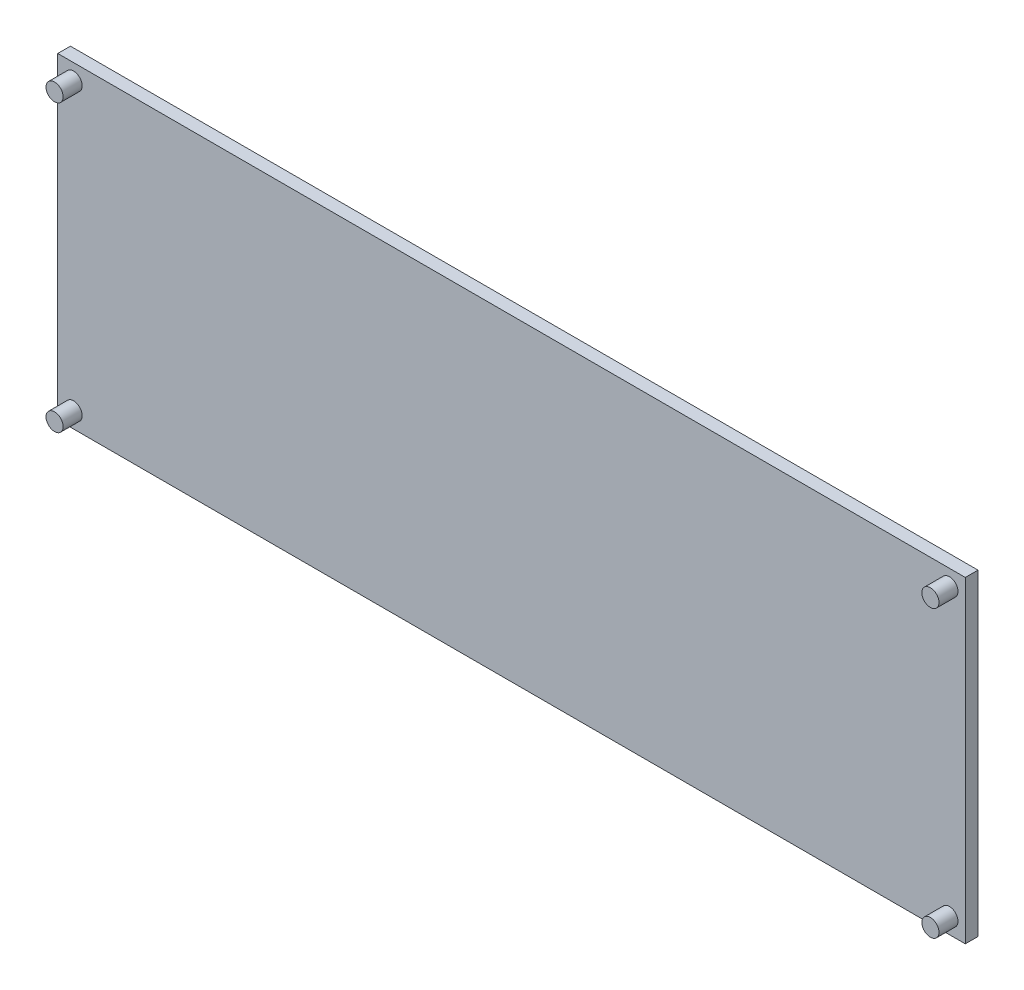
ISO-10303-21;
HEADER;
FILE_DESCRIPTION(('STEP AP214'),'2;1');
FILE_NAME('part.step','',(''),(''),'','','');
FILE_SCHEMA(('AUTOMOTIVE_DESIGN { 1 0 10303 214 1 1 1 1 }'));
ENDSEC;
DATA;
#1=APPLICATION_CONTEXT('core data for automotive mechanical design processes');
#2=APPLICATION_PROTOCOL_DEFINITION('international standard','automotive_design',2000,#1);
#3=PRODUCT_CONTEXT('',#1,'mechanical');
#4=PRODUCT('Part','Part','',(#3));
#5=PRODUCT_RELATED_PRODUCT_CATEGORY('part','',(#4));
#6=PRODUCT_DEFINITION_FORMATION('','',#4);
#7=PRODUCT_DEFINITION_CONTEXT('part definition',#1,'design');
#8=PRODUCT_DEFINITION('design','',#6,#7);
#9=PRODUCT_DEFINITION_SHAPE('','',#8);
#10=(LENGTH_UNIT() NAMED_UNIT(*) SI_UNIT(.MILLI.,.METRE.));
#11=(NAMED_UNIT(*) PLANE_ANGLE_UNIT() SI_UNIT($,.RADIAN.));
#12=(NAMED_UNIT(*) SI_UNIT($,.STERADIAN.) SOLID_ANGLE_UNIT());
#13=UNCERTAINTY_MEASURE_WITH_UNIT(LENGTH_MEASURE(1.E-05),#10,'distance_accuracy_value','');
#14=(GEOMETRIC_REPRESENTATION_CONTEXT(3) GLOBAL_UNCERTAINTY_ASSIGNED_CONTEXT((#13)) GLOBAL_UNIT_ASSIGNED_CONTEXT((#10,
#11,#12)) REPRESENTATION_CONTEXT('',''));
#15=CARTESIAN_POINT('',(0.,0.,0.));
#16=DIRECTION('',(0.,0.,1.));
#17=DIRECTION('',(1.,0.,0.));
#18=AXIS2_PLACEMENT_3D('',#15,#16,#17);
#19=CARTESIAN_POINT('',(0.,0.,2.));
#20=DIRECTION('',(0.,0.,-1.));
#21=DIRECTION('',(-1.,0.,0.));
#22=AXIS2_PLACEMENT_3D('',#19,#20,#21);
#23=PLANE('',#22);
#24=DIRECTION('',(0.,1.,0.));
#25=VECTOR('',#24,1.);
#26=CARTESIAN_POINT('',(71.5,-25.,2.));
#27=LINE('',#26,#25);
#28=CARTESIAN_POINT('',(71.5,-25.,2.));
#29=VERTEX_POINT('',#28);
#30=CARTESIAN_POINT('',(71.5,25.,2.));
#31=VERTEX_POINT('',#30);
#32=EDGE_CURVE('E89',#29,#31,#27,.T.);
#33=ORIENTED_EDGE('',*,*,#32,.T.);
#34=DIRECTION('',(-1.,0.,0.));
#35=VECTOR('',#34,1.);
#36=CARTESIAN_POINT('',(-71.5,25.,2.));
#37=LINE('',#36,#35);
#38=CARTESIAN_POINT('',(-71.5,25.,2.));
#39=VERTEX_POINT('',#38);
#40=EDGE_CURVE('E84',#31,#39,#37,.T.);
#41=ORIENTED_EDGE('',*,*,#40,.T.);
#42=DIRECTION('',(0.,-1.,0.));
#43=VECTOR('',#42,1.);
#44=CARTESIAN_POINT('',(-71.5,-25.,2.));
#45=LINE('',#44,#43);
#46=CARTESIAN_POINT('',(-71.5,-25.,2.));
#47=VERTEX_POINT('',#46);
#48=EDGE_CURVE('E87',#39,#47,#45,.T.);
#49=ORIENTED_EDGE('',*,*,#48,.T.);
#50=DIRECTION('',(1.,0.,0.));
#51=VECTOR('',#50,1.);
#52=CARTESIAN_POINT('',(-71.5,-25.,2.));
#53=LINE('',#52,#51);
#54=EDGE_CURVE('E54',#47,#29,#53,.T.);
#55=ORIENTED_EDGE('',*,*,#54,.T.);
#56=EDGE_LOOP('',(#33,#41,#49,#55));
#57=FACE_BOUND('',#56,.T.);
#58=CARTESIAN_POINT('',(-69.,22.5,2.));
#59=DIRECTION('',(0.,0.,1.));
#60=DIRECTION('',(1.,0.,0.));
#61=AXIS2_PLACEMENT_3D('',#58,#59,#60);
#62=CIRCLE('',#61,1.35000000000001);
#63=CARTESIAN_POINT('',(-67.65,22.5,2.));
#64=VERTEX_POINT('',#63);
#65=EDGE_CURVE('E104',#64,#64,#62,.T.);
#66=ORIENTED_EDGE('',*,*,#65,.F.);
#67=EDGE_LOOP('',(#66));
#68=FACE_BOUND('',#67,.T.);
#69=CARTESIAN_POINT('',(-69.,-22.5,2.));
#70=DIRECTION('',(0.,0.,1.));
#71=DIRECTION('',(-1.,0.,0.));
#72=AXIS2_PLACEMENT_3D('',#69,#70,#71);
#73=CIRCLE('',#72,1.35000000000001);
#74=CARTESIAN_POINT('',(-70.35,-22.5,2.));
#75=VERTEX_POINT('',#74);
#76=EDGE_CURVE('E117',#75,#75,#73,.T.);
#77=ORIENTED_EDGE('',*,*,#76,.F.);
#78=EDGE_LOOP('',(#77));
#79=FACE_BOUND('',#78,.T.);
#80=CARTESIAN_POINT('',(69.,22.5,2.));
#81=DIRECTION('',(0.,0.,1.));
#82=DIRECTION('',(-1.,0.,0.));
#83=AXIS2_PLACEMENT_3D('',#80,#81,#82);
#84=CIRCLE('',#83,1.35000000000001);
#85=CARTESIAN_POINT('',(67.65,22.5,2.));
#86=VERTEX_POINT('',#85);
#87=EDGE_CURVE('E120',#86,#86,#84,.T.);
#88=ORIENTED_EDGE('',*,*,#87,.F.);
#89=EDGE_LOOP('',(#88));
#90=FACE_BOUND('',#89,.T.);
#91=CARTESIAN_POINT('',(69.,-22.5,2.));
#92=DIRECTION('',(0.,0.,1.));
#93=DIRECTION('',(1.,0.,0.));
#94=AXIS2_PLACEMENT_3D('',#91,#92,#93);
#95=CIRCLE('',#94,1.35000000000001);
#96=CARTESIAN_POINT('',(70.35,-22.5,2.));
#97=VERTEX_POINT('',#96);
#98=EDGE_CURVE('E123',#97,#97,#95,.T.);
#99=ORIENTED_EDGE('',*,*,#98,.F.);
#100=EDGE_LOOP('',(#99));
#101=FACE_BOUND('',#100,.T.);
#102=ADVANCED_FACE('F37',(#57,#68,#79,#90,#101),#23,.F.);
#103=CARTESIAN_POINT('',(0.,0.,0.));
#104=DIRECTION('',(0.,0.,-1.));
#105=DIRECTION('',(-1.,0.,0.));
#106=AXIS2_PLACEMENT_3D('',#103,#104,#105);
#107=PLANE('',#106);
#108=DIRECTION('',(0.,1.,0.));
#109=VECTOR('',#108,1.);
#110=CARTESIAN_POINT('',(71.5,-25.,0.));
#111=LINE('',#110,#109);
#112=CARTESIAN_POINT('',(71.5,-25.,0.));
#113=VERTEX_POINT('',#112);
#114=CARTESIAN_POINT('',(71.5,25.,0.));
#115=VERTEX_POINT('',#114);
#116=EDGE_CURVE('E101',#113,#115,#111,.T.);
#117=ORIENTED_EDGE('',*,*,#116,.F.);
#118=DIRECTION('',(1.,0.,0.));
#119=VECTOR('',#118,1.);
#120=CARTESIAN_POINT('',(-71.5,-25.,0.));
#121=LINE('',#120,#119);
#122=CARTESIAN_POINT('',(-71.5,-25.,0.));
#123=VERTEX_POINT('',#122);
#124=EDGE_CURVE('E77',#123,#113,#121,.T.);
#125=ORIENTED_EDGE('',*,*,#124,.F.);
#126=DIRECTION('',(0.,-1.,0.));
#127=VECTOR('',#126,1.);
#128=CARTESIAN_POINT('',(-71.5,-25.,0.));
#129=LINE('',#128,#127);
#130=CARTESIAN_POINT('',(-71.5,25.,0.));
#131=VERTEX_POINT('',#130);
#132=EDGE_CURVE('E71',#131,#123,#129,.T.);
#133=ORIENTED_EDGE('',*,*,#132,.F.);
#134=DIRECTION('',(-1.,0.,0.));
#135=VECTOR('',#134,1.);
#136=CARTESIAN_POINT('',(-71.5,25.,0.));
#137=LINE('',#136,#135);
#138=EDGE_CURVE('E93',#115,#131,#137,.T.);
#139=ORIENTED_EDGE('',*,*,#138,.F.);
#140=EDGE_LOOP('',(#117,#125,#133,#139));
#141=FACE_BOUND('',#140,.T.);
#142=ADVANCED_FACE('F112',(#141),#107,.T.);
#143=CARTESIAN_POINT('',(71.5,-25.,2.));
#144=DIRECTION('',(-1.,0.,0.));
#145=DIRECTION('',(0.,0.,1.));
#146=AXIS2_PLACEMENT_3D('',#143,#144,#145);
#147=PLANE('',#146);
#148=ORIENTED_EDGE('',*,*,#116,.T.);
#149=DIRECTION('',(0.,0.,-1.));
#150=VECTOR('',#149,1.);
#151=CARTESIAN_POINT('',(71.5,25.,2.));
#152=LINE('',#151,#150);
#153=EDGE_CURVE('E11',#31,#115,#152,.T.);
#154=ORIENTED_EDGE('',*,*,#153,.F.);
#155=ORIENTED_EDGE('',*,*,#32,.F.);
#156=DIRECTION('',(0.,0.,-1.));
#157=VECTOR('',#156,1.);
#158=CARTESIAN_POINT('',(71.5,-25.,2.));
#159=LINE('',#158,#157);
#160=EDGE_CURVE('E97',#29,#113,#159,.T.);
#161=ORIENTED_EDGE('',*,*,#160,.T.);
#162=EDGE_LOOP('',(#148,#154,#155,#161));
#163=FACE_BOUND('',#162,.T.);
#164=ADVANCED_FACE('F39',(#163),#147,.F.);
#165=CARTESIAN_POINT('',(-71.5,25.,2.));
#166=DIRECTION('',(0.,-1.,0.));
#167=DIRECTION('',(0.,0.,-1.));
#168=AXIS2_PLACEMENT_3D('',#165,#166,#167);
#169=PLANE('',#168);
#170=ORIENTED_EDGE('',*,*,#138,.T.);
#171=DIRECTION('',(0.,0.,-1.));
#172=VECTOR('',#171,1.);
#173=CARTESIAN_POINT('',(-71.5,25.,2.));
#174=LINE('',#173,#172);
#175=EDGE_CURVE('E46',#39,#131,#174,.T.);
#176=ORIENTED_EDGE('',*,*,#175,.F.);
#177=ORIENTED_EDGE('',*,*,#40,.F.);
#178=ORIENTED_EDGE('',*,*,#153,.T.);
#179=EDGE_LOOP('',(#170,#176,#177,#178));
#180=FACE_BOUND('',#179,.T.);
#181=ADVANCED_FACE('F92',(#180),#169,.F.);
#182=CARTESIAN_POINT('',(-71.5,-25.,2.));
#183=DIRECTION('',(1.,0.,0.));
#184=DIRECTION('',(0.,0.,-1.));
#185=AXIS2_PLACEMENT_3D('',#182,#183,#184);
#186=PLANE('',#185);
#187=ORIENTED_EDGE('',*,*,#132,.T.);
#188=DIRECTION('',(0.,0.,-1.));
#189=VECTOR('',#188,1.);
#190=CARTESIAN_POINT('',(-71.5,-25.,2.));
#191=LINE('',#190,#189);
#192=EDGE_CURVE('E94',#47,#123,#191,.T.);
#193=ORIENTED_EDGE('',*,*,#192,.F.);
#194=ORIENTED_EDGE('',*,*,#48,.F.);
#195=ORIENTED_EDGE('',*,*,#175,.T.);
#196=EDGE_LOOP('',(#187,#193,#194,#195));
#197=FACE_BOUND('',#196,.T.);
#198=ADVANCED_FACE('F95',(#197),#186,.F.);
#199=CARTESIAN_POINT('',(-71.5,-25.,2.));
#200=DIRECTION('',(0.,1.,0.));
#201=DIRECTION('',(0.,0.,1.));
#202=AXIS2_PLACEMENT_3D('',#199,#200,#201);
#203=PLANE('',#202);
#204=ORIENTED_EDGE('',*,*,#124,.T.);
#205=ORIENTED_EDGE('',*,*,#160,.F.);
#206=ORIENTED_EDGE('',*,*,#54,.F.);
#207=ORIENTED_EDGE('',*,*,#192,.T.);
#208=EDGE_LOOP('',(#204,#205,#206,#207));
#209=FACE_BOUND('',#208,.T.);
#210=ADVANCED_FACE('F109',(#209),#203,.F.);
#211=CARTESIAN_POINT('',(-69.,-22.5,5.));
#212=DIRECTION('',(0.,0.,-1.));
#213=DIRECTION('',(-1.,0.,0.));
#214=AXIS2_PLACEMENT_3D('',#211,#212,#213);
#215=CYLINDRICAL_SURFACE('',#214,1.35000000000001);
#216=CARTESIAN_POINT('',(-69.,-22.5,5.));
#217=DIRECTION('',(0.,0.,1.));
#218=DIRECTION('',(1.,0.,0.));
#219=AXIS2_PLACEMENT_3D('',#216,#217,#218);
#220=CIRCLE('',#219,1.35000000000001);
#221=CARTESIAN_POINT('',(-67.65,-22.5,5.));
#222=VERTEX_POINT('',#221);
#223=EDGE_CURVE('E126',#222,#222,#220,.F.);
#224=ORIENTED_EDGE('',*,*,#223,.T.);
#225=EDGE_LOOP('',(#224));
#226=FACE_BOUND('',#225,.T.);
#227=ORIENTED_EDGE('',*,*,#76,.T.);
#228=EDGE_LOOP('',(#227));
#229=FACE_BOUND('',#228,.T.);
#230=ADVANCED_FACE('F169',(#226,#229),#215,.T.);
#231=CARTESIAN_POINT('',(0.,0.,5.));
#232=DIRECTION('',(0.,0.,1.));
#233=DIRECTION('',(1.,0.,0.));
#234=AXIS2_PLACEMENT_3D('',#231,#232,#233);
#235=PLANE('',#234);
#236=ORIENTED_EDGE('',*,*,#223,.F.);
#237=EDGE_LOOP('',(#236));
#238=FACE_BOUND('',#237,.T.);
#239=ADVANCED_FACE('F159',(#238),#235,.T.);
#240=CARTESIAN_POINT('',(69.,-22.5,5.));
#241=DIRECTION('',(0.,0.,-1.));
#242=DIRECTION('',(-1.,0.,0.));
#243=AXIS2_PLACEMENT_3D('',#240,#241,#242);
#244=CYLINDRICAL_SURFACE('',#243,1.35000000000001);
#245=CARTESIAN_POINT('',(69.,-22.5,5.));
#246=DIRECTION('',(0.,0.,1.));
#247=DIRECTION('',(1.,0.,0.));
#248=AXIS2_PLACEMENT_3D('',#245,#246,#247);
#249=CIRCLE('',#248,1.35000000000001);
#250=CARTESIAN_POINT('',(70.35,-22.5,5.));
#251=VERTEX_POINT('',#250);
#252=EDGE_CURVE('E129',#251,#251,#249,.T.);
#253=ORIENTED_EDGE('',*,*,#252,.F.);
#254=EDGE_LOOP('',(#253));
#255=FACE_BOUND('',#254,.T.);
#256=ORIENTED_EDGE('',*,*,#98,.T.);
#257=EDGE_LOOP('',(#256));
#258=FACE_BOUND('',#257,.T.);
#259=ADVANCED_FACE('F156',(#255,#258),#244,.T.);
#260=CARTESIAN_POINT('',(0.,0.,5.));
#261=DIRECTION('',(0.,0.,1.));
#262=DIRECTION('',(1.,0.,0.));
#263=AXIS2_PLACEMENT_3D('',#260,#261,#262);
#264=PLANE('',#263);
#265=ORIENTED_EDGE('',*,*,#252,.T.);
#266=EDGE_LOOP('',(#265));
#267=FACE_BOUND('',#266,.T.);
#268=ADVANCED_FACE('F158',(#267),#264,.T.);
#269=CARTESIAN_POINT('',(69.,22.5,5.));
#270=DIRECTION('',(0.,0.,-1.));
#271=DIRECTION('',(-1.,0.,0.));
#272=AXIS2_PLACEMENT_3D('',#269,#270,#271);
#273=CYLINDRICAL_SURFACE('',#272,1.35000000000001);
#274=CARTESIAN_POINT('',(69.,22.5,5.));
#275=DIRECTION('',(0.,0.,1.));
#276=DIRECTION('',(1.,0.,0.));
#277=AXIS2_PLACEMENT_3D('',#274,#275,#276);
#278=CIRCLE('',#277,1.35000000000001);
#279=CARTESIAN_POINT('',(70.35,22.5,5.));
#280=VERTEX_POINT('',#279);
#281=EDGE_CURVE('E132',#280,#280,#278,.F.);
#282=ORIENTED_EDGE('',*,*,#281,.T.);
#283=EDGE_LOOP('',(#282));
#284=FACE_BOUND('',#283,.T.);
#285=ORIENTED_EDGE('',*,*,#87,.T.);
#286=EDGE_LOOP('',(#285));
#287=FACE_BOUND('',#286,.T.);
#288=ADVANCED_FACE('F166',(#284,#287),#273,.T.);
#289=CARTESIAN_POINT('',(0.,0.,5.));
#290=DIRECTION('',(0.,0.,1.));
#291=DIRECTION('',(1.,0.,0.));
#292=AXIS2_PLACEMENT_3D('',#289,#290,#291);
#293=PLANE('',#292);
#294=ORIENTED_EDGE('',*,*,#281,.F.);
#295=EDGE_LOOP('',(#294));
#296=FACE_BOUND('',#295,.T.);
#297=ADVANCED_FACE('F144',(#296),#293,.T.);
#298=CARTESIAN_POINT('',(-69.,22.5,5.));
#299=DIRECTION('',(0.,0.,-1.));
#300=DIRECTION('',(-1.,0.,0.));
#301=AXIS2_PLACEMENT_3D('',#298,#299,#300);
#302=CYLINDRICAL_SURFACE('',#301,1.35000000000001);
#303=CARTESIAN_POINT('',(-69.,22.5,5.));
#304=DIRECTION('',(0.,0.,1.));
#305=DIRECTION('',(1.,0.,0.));
#306=AXIS2_PLACEMENT_3D('',#303,#304,#305);
#307=CIRCLE('',#306,1.35000000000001);
#308=CARTESIAN_POINT('',(-67.65,22.5,5.));
#309=VERTEX_POINT('',#308);
#310=EDGE_CURVE('E135',#309,#309,#307,.T.);
#311=ORIENTED_EDGE('',*,*,#310,.F.);
#312=EDGE_LOOP('',(#311));
#313=FACE_BOUND('',#312,.T.);
#314=ORIENTED_EDGE('',*,*,#65,.T.);
#315=EDGE_LOOP('',(#314));
#316=FACE_BOUND('',#315,.T.);
#317=ADVANCED_FACE('F141',(#313,#316),#302,.T.);
#318=CARTESIAN_POINT('',(-69.,22.5,5.));
#319=DIRECTION('',(0.,0.,1.));
#320=DIRECTION('',(1.,0.,0.));
#321=AXIS2_PLACEMENT_3D('',#318,#319,#320);
#322=PLANE('',#321);
#323=ORIENTED_EDGE('',*,*,#310,.T.);
#324=EDGE_LOOP('',(#323));
#325=FACE_BOUND('',#324,.T.);
#326=ADVANCED_FACE('F139',(#325),#322,.T.);
#327=CLOSED_SHELL('',(#102,#142,#164,#181,#198,#210,#230,#239,#259,#268,#288,#297,#317,#326));
#328=MANIFOLD_SOLID_BREP('B2',#327);
#329=ADVANCED_BREP_SHAPE_REPRESENTATION('',(#18,#328),#14);
#330=SHAPE_DEFINITION_REPRESENTATION(#9,#329);
ENDSEC;
END-ISO-10303-21;
